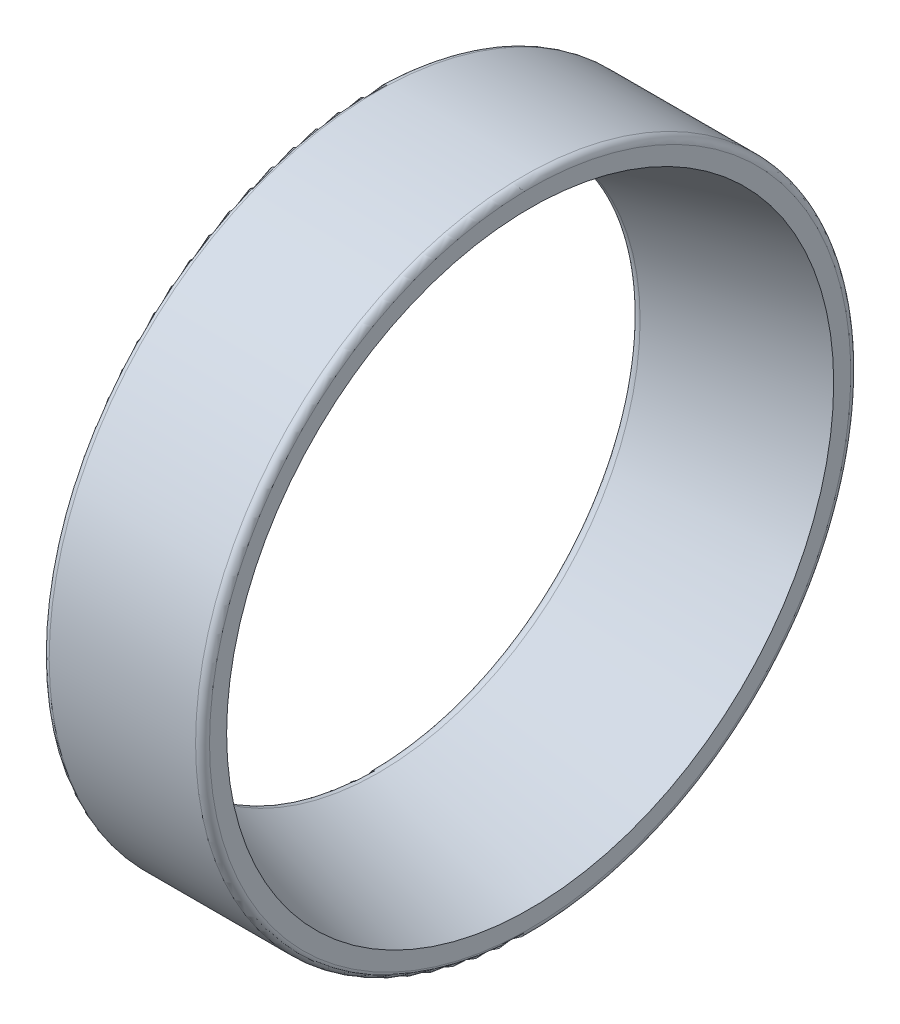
ISO-10303-21;
HEADER;
FILE_DESCRIPTION(('STEP AP214'),'2;1');
FILE_NAME('part.step','',(''),(''),'','','');
FILE_SCHEMA(('AUTOMOTIVE_DESIGN { 1 0 10303 214 1 1 1 1 }'));
ENDSEC;
DATA;
#1=APPLICATION_CONTEXT('core data for automotive mechanical design processes');
#2=APPLICATION_PROTOCOL_DEFINITION('international standard','automotive_design',2000,#1);
#3=PRODUCT_CONTEXT('',#1,'mechanical');
#4=PRODUCT('Part','Part','',(#3));
#5=PRODUCT_RELATED_PRODUCT_CATEGORY('part','',(#4));
#6=PRODUCT_DEFINITION_FORMATION('','',#4);
#7=PRODUCT_DEFINITION_CONTEXT('part definition',#1,'design');
#8=PRODUCT_DEFINITION('design','',#6,#7);
#9=PRODUCT_DEFINITION_SHAPE('','',#8);
#10=(LENGTH_UNIT() NAMED_UNIT(*) SI_UNIT(.MILLI.,.METRE.));
#11=(NAMED_UNIT(*) PLANE_ANGLE_UNIT() SI_UNIT($,.RADIAN.));
#12=(NAMED_UNIT(*) SI_UNIT($,.STERADIAN.) SOLID_ANGLE_UNIT());
#13=UNCERTAINTY_MEASURE_WITH_UNIT(LENGTH_MEASURE(1.E-05),#10,'distance_accuracy_value','');
#14=(GEOMETRIC_REPRESENTATION_CONTEXT(3) GLOBAL_UNCERTAINTY_ASSIGNED_CONTEXT((#13)) GLOBAL_UNIT_ASSIGNED_CONTEXT((#10,
#11,#12)) REPRESENTATION_CONTEXT('',''));
#15=CARTESIAN_POINT('',(0.,0.,0.));
#16=DIRECTION('',(0.,0.,1.));
#17=DIRECTION('',(1.,0.,0.));
#18=AXIS2_PLACEMENT_3D('',#15,#16,#17);
#19=CARTESIAN_POINT('',(0.5,0.,0.));
#20=DIRECTION('',(-1.,0.,0.));
#21=DIRECTION('',(0.,0.,1.));
#22=AXIS2_PLACEMENT_3D('',#19,#20,#21);
#23=TOROIDAL_SURFACE('',#22,19.2347782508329,0.499999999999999);
#24=CARTESIAN_POINT('',(0.633861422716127,0.,0.));
#25=DIRECTION('',(-1.,0.,0.));
#26=DIRECTION('',(0.,0.,1.));
#27=AXIS2_PLACEMENT_3D('',#24,#25,#26);
#28=CIRCLE('',#27,18.7530302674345);
#29=CARTESIAN_POINT('',(0.633861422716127,0.,18.7530302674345));
#30=VERTEX_POINT('',#29);
#31=EDGE_CURVE('E10',#30,#30,#28,.T.);
#32=ORIENTED_EDGE('',*,*,#31,.F.);
#33=EDGE_LOOP('',(#32));
#34=FACE_BOUND('',#33,.T.);
#35=CARTESIAN_POINT('',(0.,0.,0.));
#36=DIRECTION('',(-1.,0.,0.));
#37=DIRECTION('',(0.,0.,1.));
#38=AXIS2_PLACEMENT_3D('',#35,#36,#37);
#39=CIRCLE('',#38,19.2347782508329);
#40=CARTESIAN_POINT('',(0.,0.,19.2347782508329));
#41=VERTEX_POINT('',#40);
#42=EDGE_CURVE('E49',#41,#41,#39,.T.);
#43=ORIENTED_EDGE('',*,*,#42,.T.);
#44=EDGE_LOOP('',(#43));
#45=FACE_BOUND('',#44,.T.);
#46=ADVANCED_FACE('F24',(#34,#45),#23,.T.);
#47=CARTESIAN_POINT('',(10.3068824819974,0.,0.));
#48=DIRECTION('',(1.,0.,0.));
#49=DIRECTION('',(0.,0.,-1.));
#50=AXIS2_PLACEMENT_3D('',#47,#48,#49);
#51=CONICAL_SURFACE('',#50,21.4408346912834,0.271028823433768);
#52=CARTESIAN_POINT('',(11.5,0.,0.));
#53=DIRECTION('',(-1.,0.,0.));
#54=DIRECTION('',(0.,0.,1.));
#55=AXIS2_PLACEMENT_3D('',#52,#53,#54);
#56=CIRCLE('',#55,21.7723615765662);
#57=CARTESIAN_POINT('',(11.5,0.,21.7723615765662));
#58=VERTEX_POINT('',#57);
#59=EDGE_CURVE('E30',#58,#58,#56,.T.);
#60=ORIENTED_EDGE('',*,*,#59,.F.);
#61=EDGE_LOOP('',(#60));
#62=FACE_BOUND('',#61,.T.);
#63=ORIENTED_EDGE('',*,*,#31,.T.);
#64=EDGE_LOOP('',(#63));
#65=FACE_BOUND('',#64,.T.);
#66=ADVANCED_FACE('F80',(#62,#65),#51,.F.);
#67=CARTESIAN_POINT('',(11.5,0.,-23.));
#68=DIRECTION('',(-1.,0.,0.));
#69=DIRECTION('',(0.,0.,1.));
#70=AXIS2_PLACEMENT_3D('',#67,#68,#69);
#71=PLANE('',#70);
#72=CARTESIAN_POINT('',(11.5,0.,0.));
#73=DIRECTION('',(-1.,0.,0.));
#74=DIRECTION('',(0.,0.,1.));
#75=AXIS2_PLACEMENT_3D('',#72,#73,#74);
#76=CIRCLE('',#75,23.);
#77=CARTESIAN_POINT('',(11.5,0.,23.));
#78=VERTEX_POINT('',#77);
#79=EDGE_CURVE('E34',#78,#78,#76,.T.);
#80=ORIENTED_EDGE('',*,*,#79,.F.);
#81=EDGE_LOOP('',(#80));
#82=FACE_BOUND('',#81,.T.);
#83=ORIENTED_EDGE('',*,*,#59,.T.);
#84=EDGE_LOOP('',(#83));
#85=FACE_BOUND('',#84,.T.);
#86=ADVANCED_FACE('F75',(#82,#85),#71,.F.);
#87=CARTESIAN_POINT('',(11.,0.,0.));
#88=DIRECTION('',(-1.,0.,0.));
#89=DIRECTION('',(0.,0.,1.));
#90=AXIS2_PLACEMENT_3D('',#87,#88,#89);
#91=TOROIDAL_SURFACE('',#90,23.,0.500000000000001);
#92=CARTESIAN_POINT('',(11.,0.,0.));
#93=DIRECTION('',(-1.,0.,0.));
#94=DIRECTION('',(0.,0.,1.));
#95=AXIS2_PLACEMENT_3D('',#92,#93,#94);
#96=CIRCLE('',#95,23.5);
#97=CARTESIAN_POINT('',(11.,0.,23.5));
#98=VERTEX_POINT('',#97);
#99=EDGE_CURVE('E38',#98,#98,#96,.T.);
#100=ORIENTED_EDGE('',*,*,#99,.F.);
#101=EDGE_LOOP('',(#100));
#102=FACE_BOUND('',#101,.T.);
#103=ORIENTED_EDGE('',*,*,#79,.T.);
#104=EDGE_LOOP('',(#103));
#105=FACE_BOUND('',#104,.T.);
#106=ADVANCED_FACE('F69',(#102,#105),#91,.T.);
#107=CARTESIAN_POINT('',(0.,0.,0.));
#108=DIRECTION('',(-1.,0.,0.));
#109=DIRECTION('',(0.,0.,1.));
#110=AXIS2_PLACEMENT_3D('',#107,#108,#109);
#111=CYLINDRICAL_SURFACE('',#110,23.5);
#112=CARTESIAN_POINT('',(0.5,0.,0.));
#113=DIRECTION('',(-1.,0.,0.));
#114=DIRECTION('',(0.,0.,1.));
#115=AXIS2_PLACEMENT_3D('',#112,#113,#114);
#116=CIRCLE('',#115,23.5);
#117=CARTESIAN_POINT('',(0.5,0.,23.5));
#118=VERTEX_POINT('',#117);
#119=EDGE_CURVE('E43',#118,#118,#116,.T.);
#120=ORIENTED_EDGE('',*,*,#119,.F.);
#121=EDGE_LOOP('',(#120));
#122=FACE_BOUND('',#121,.T.);
#123=ORIENTED_EDGE('',*,*,#99,.T.);
#124=EDGE_LOOP('',(#123));
#125=FACE_BOUND('',#124,.T.);
#126=ADVANCED_FACE('F63',(#122,#125),#111,.T.);
#127=CARTESIAN_POINT('',(0.5,0.,0.));
#128=DIRECTION('',(-1.,0.,0.));
#129=DIRECTION('',(0.,0.,1.));
#130=AXIS2_PLACEMENT_3D('',#127,#128,#129);
#131=TOROIDAL_SURFACE('',#130,23.,0.5);
#132=CARTESIAN_POINT('',(0.,0.,0.));
#133=DIRECTION('',(-1.,0.,0.));
#134=DIRECTION('',(0.,0.,1.));
#135=AXIS2_PLACEMENT_3D('',#132,#133,#134);
#136=CIRCLE('',#135,23.);
#137=CARTESIAN_POINT('',(0.,0.,23.));
#138=VERTEX_POINT('',#137);
#139=EDGE_CURVE('E46',#138,#138,#136,.T.);
#140=ORIENTED_EDGE('',*,*,#139,.F.);
#141=EDGE_LOOP('',(#140));
#142=FACE_BOUND('',#141,.T.);
#143=ORIENTED_EDGE('',*,*,#119,.T.);
#144=EDGE_LOOP('',(#143));
#145=FACE_BOUND('',#144,.T.);
#146=ADVANCED_FACE('F57',(#142,#145),#131,.T.);
#147=CARTESIAN_POINT('',(0.,0.,-19.2347782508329));
#148=DIRECTION('',(1.,0.,0.));
#149=DIRECTION('',(0.,0.,-1.));
#150=AXIS2_PLACEMENT_3D('',#147,#148,#149);
#151=PLANE('',#150);
#152=ORIENTED_EDGE('',*,*,#42,.F.);
#153=EDGE_LOOP('',(#152));
#154=FACE_BOUND('',#153,.T.);
#155=ORIENTED_EDGE('',*,*,#139,.T.);
#156=EDGE_LOOP('',(#155));
#157=FACE_BOUND('',#156,.T.);
#158=ADVANCED_FACE('F54',(#154,#157),#151,.F.);
#159=CLOSED_SHELL('',(#46,#66,#86,#106,#126,#146,#158));
#160=MANIFOLD_SOLID_BREP('B2',#159);
#161=ADVANCED_BREP_SHAPE_REPRESENTATION('',(#18,#160),#14);
#162=SHAPE_DEFINITION_REPRESENTATION(#9,#161);
ENDSEC;
END-ISO-10303-21;
